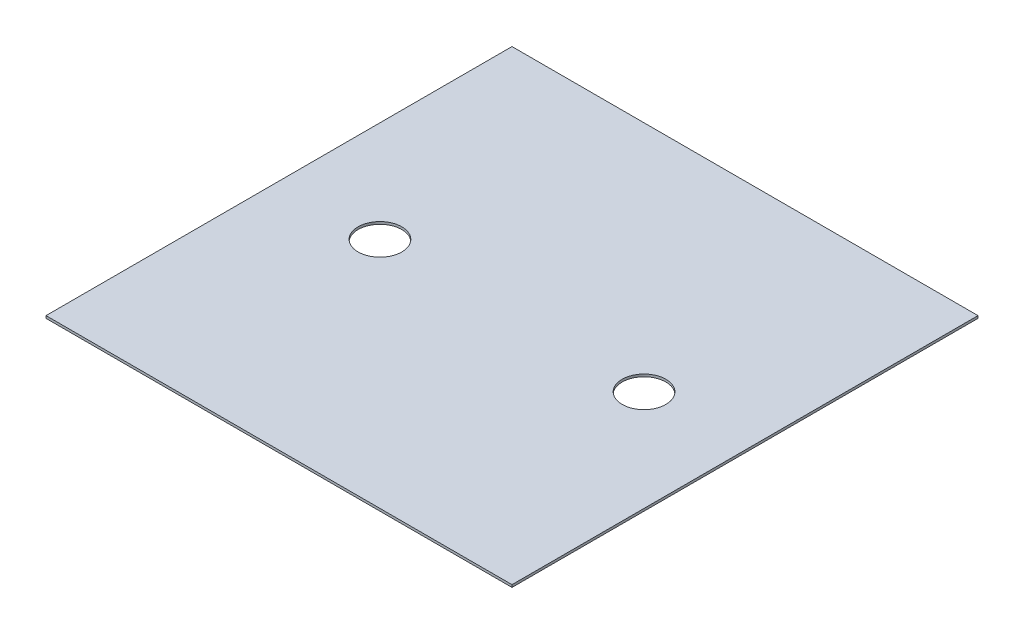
ISO-10303-21;
HEADER;
FILE_DESCRIPTION(('STEP AP214'),'2;1');
FILE_NAME('part.step','',(''),(''),'','','');
FILE_SCHEMA(('AUTOMOTIVE_DESIGN { 1 0 10303 214 1 1 1 1 }'));
ENDSEC;
DATA;
#1=APPLICATION_CONTEXT('core data for automotive mechanical design processes');
#2=APPLICATION_PROTOCOL_DEFINITION('international standard','automotive_design',2000,#1);
#3=PRODUCT_CONTEXT('',#1,'mechanical');
#4=PRODUCT('Part','Part','',(#3));
#5=PRODUCT_RELATED_PRODUCT_CATEGORY('part','',(#4));
#6=PRODUCT_DEFINITION_FORMATION('','',#4);
#7=PRODUCT_DEFINITION_CONTEXT('part definition',#1,'design');
#8=PRODUCT_DEFINITION('design','',#6,#7);
#9=PRODUCT_DEFINITION_SHAPE('','',#8);
#10=(LENGTH_UNIT() NAMED_UNIT(*) SI_UNIT(.MILLI.,.METRE.));
#11=(NAMED_UNIT(*) PLANE_ANGLE_UNIT() SI_UNIT($,.RADIAN.));
#12=(NAMED_UNIT(*) SI_UNIT($,.STERADIAN.) SOLID_ANGLE_UNIT());
#13=UNCERTAINTY_MEASURE_WITH_UNIT(LENGTH_MEASURE(1.E-05),#10,'distance_accuracy_value','');
#14=(GEOMETRIC_REPRESENTATION_CONTEXT(3) GLOBAL_UNCERTAINTY_ASSIGNED_CONTEXT((#13)) GLOBAL_UNIT_ASSIGNED_CONTEXT((#10,
#11,#12)) REPRESENTATION_CONTEXT('',''));
#15=CARTESIAN_POINT('',(0.,0.,0.));
#16=DIRECTION('',(0.,0.,1.));
#17=DIRECTION('',(1.,0.,0.));
#18=AXIS2_PLACEMENT_3D('',#15,#16,#17);
#19=CARTESIAN_POINT('',(-76.2,0.79375,-76.2));
#20=DIRECTION('',(1.,0.,0.));
#21=DIRECTION('',(0.,0.,-1.));
#22=AXIS2_PLACEMENT_3D('',#19,#20,#21);
#23=PLANE('',#22);
#24=DIRECTION('',(0.,0.,1.));
#25=VECTOR('',#24,1.);
#26=CARTESIAN_POINT('',(-76.2,0.,-76.2));
#27=LINE('',#26,#25);
#28=CARTESIAN_POINT('',(-76.2,0.,-76.2));
#29=VERTEX_POINT('',#28);
#30=CARTESIAN_POINT('',(-76.2,0.,76.2));
#31=VERTEX_POINT('',#30);
#32=EDGE_CURVE('E96',#29,#31,#27,.T.);
#33=ORIENTED_EDGE('',*,*,#32,.T.);
#34=DIRECTION('',(0.,-1.,0.));
#35=VECTOR('',#34,1.);
#36=CARTESIAN_POINT('',(-76.2,0.79375,76.2));
#37=LINE('',#36,#35);
#38=CARTESIAN_POINT('',(-76.2,0.79375,76.2));
#39=VERTEX_POINT('',#38);
#40=EDGE_CURVE('E11',#39,#31,#37,.T.);
#41=ORIENTED_EDGE('',*,*,#40,.F.);
#42=DIRECTION('',(0.,0.,1.));
#43=VECTOR('',#42,1.);
#44=CARTESIAN_POINT('',(-76.2,0.79375,-76.2));
#45=LINE('',#44,#43);
#46=CARTESIAN_POINT('',(-76.2,0.79375,-76.2));
#47=VERTEX_POINT('',#46);
#48=EDGE_CURVE('E84',#47,#39,#45,.T.);
#49=ORIENTED_EDGE('',*,*,#48,.F.);
#50=DIRECTION('',(0.,-1.,0.));
#51=VECTOR('',#50,1.);
#52=CARTESIAN_POINT('',(-76.2,0.79375,-76.2));
#53=LINE('',#52,#51);
#54=EDGE_CURVE('E92',#47,#29,#53,.T.);
#55=ORIENTED_EDGE('',*,*,#54,.T.);
#56=EDGE_LOOP('',(#33,#41,#49,#55));
#57=FACE_BOUND('',#56,.T.);
#58=ADVANCED_FACE('F33',(#57),#23,.F.);
#59=CARTESIAN_POINT('',(-76.2,0.79375,76.2));
#60=DIRECTION('',(0.,0.,-1.));
#61=DIRECTION('',(-1.,0.,0.));
#62=AXIS2_PLACEMENT_3D('',#59,#60,#61);
#63=PLANE('',#62);
#64=DIRECTION('',(1.,0.,0.));
#65=VECTOR('',#64,1.);
#66=CARTESIAN_POINT('',(-76.2,0.,76.2));
#67=LINE('',#66,#65);
#68=CARTESIAN_POINT('',(76.2,0.,76.2));
#69=VERTEX_POINT('',#68);
#70=EDGE_CURVE('E88',#31,#69,#67,.T.);
#71=ORIENTED_EDGE('',*,*,#70,.T.);
#72=DIRECTION('',(0.,-1.,0.));
#73=VECTOR('',#72,1.);
#74=CARTESIAN_POINT('',(76.2,0.79375,76.2));
#75=LINE('',#74,#73);
#76=CARTESIAN_POINT('',(76.2,0.79375,76.2));
#77=VERTEX_POINT('',#76);
#78=EDGE_CURVE('E41',#77,#69,#75,.T.);
#79=ORIENTED_EDGE('',*,*,#78,.F.);
#80=DIRECTION('',(1.,0.,0.));
#81=VECTOR('',#80,1.);
#82=CARTESIAN_POINT('',(-76.2,0.79375,76.2));
#83=LINE('',#82,#81);
#84=EDGE_CURVE('E79',#39,#77,#83,.T.);
#85=ORIENTED_EDGE('',*,*,#84,.F.);
#86=ORIENTED_EDGE('',*,*,#40,.T.);
#87=EDGE_LOOP('',(#71,#79,#85,#86));
#88=FACE_BOUND('',#87,.T.);
#89=ADVANCED_FACE('F87',(#88),#63,.F.);
#90=CARTESIAN_POINT('',(76.2,0.79375,-76.2));
#91=DIRECTION('',(-1.,0.,0.));
#92=DIRECTION('',(0.,0.,1.));
#93=AXIS2_PLACEMENT_3D('',#90,#91,#92);
#94=PLANE('',#93);
#95=DIRECTION('',(0.,0.,-1.));
#96=VECTOR('',#95,1.);
#97=CARTESIAN_POINT('',(76.2,0.,-76.2));
#98=LINE('',#97,#96);
#99=CARTESIAN_POINT('',(76.2,0.,-76.2));
#100=VERTEX_POINT('',#99);
#101=EDGE_CURVE('E66',#69,#100,#98,.T.);
#102=ORIENTED_EDGE('',*,*,#101,.T.);
#103=DIRECTION('',(0.,-1.,0.));
#104=VECTOR('',#103,1.);
#105=CARTESIAN_POINT('',(76.2,0.79375,-76.2));
#106=LINE('',#105,#104);
#107=CARTESIAN_POINT('',(76.2,0.79375,-76.2));
#108=VERTEX_POINT('',#107);
#109=EDGE_CURVE('E89',#108,#100,#106,.T.);
#110=ORIENTED_EDGE('',*,*,#109,.F.);
#111=DIRECTION('',(0.,0.,-1.));
#112=VECTOR('',#111,1.);
#113=CARTESIAN_POINT('',(76.2,0.79375,-76.2));
#114=LINE('',#113,#112);
#115=EDGE_CURVE('E82',#77,#108,#114,.T.);
#116=ORIENTED_EDGE('',*,*,#115,.F.);
#117=ORIENTED_EDGE('',*,*,#78,.T.);
#118=EDGE_LOOP('',(#102,#110,#116,#117));
#119=FACE_BOUND('',#118,.T.);
#120=ADVANCED_FACE('F90',(#119),#94,.F.);
#121=CARTESIAN_POINT('',(-76.2,0.79375,-76.2));
#122=DIRECTION('',(0.,0.,1.));
#123=DIRECTION('',(1.,0.,0.));
#124=AXIS2_PLACEMENT_3D('',#121,#122,#123);
#125=PLANE('',#124);
#126=DIRECTION('',(-1.,0.,0.));
#127=VECTOR('',#126,1.);
#128=CARTESIAN_POINT('',(-76.2,0.,-76.2));
#129=LINE('',#128,#127);
#130=EDGE_CURVE('E72',#100,#29,#129,.T.);
#131=ORIENTED_EDGE('',*,*,#130,.T.);
#132=ORIENTED_EDGE('',*,*,#54,.F.);
#133=DIRECTION('',(-1.,0.,0.));
#134=VECTOR('',#133,1.);
#135=CARTESIAN_POINT('',(-76.2,0.79375,-76.2));
#136=LINE('',#135,#134);
#137=EDGE_CURVE('E49',#108,#47,#136,.T.);
#138=ORIENTED_EDGE('',*,*,#137,.F.);
#139=ORIENTED_EDGE('',*,*,#109,.T.);
#140=EDGE_LOOP('',(#131,#132,#138,#139));
#141=FACE_BOUND('',#140,.T.);
#142=ADVANCED_FACE('F104',(#141),#125,.F.);
#143=CARTESIAN_POINT('',(0.,0.79375,0.));
#144=DIRECTION('',(0.,1.,0.));
#145=DIRECTION('',(0.,0.,1.));
#146=AXIS2_PLACEMENT_3D('',#143,#144,#145);
#147=PLANE('',#146);
#148=CARTESIAN_POINT('',(-43.18,0.793749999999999,0.));
#149=DIRECTION('',(0.,1.,0.));
#150=DIRECTION('',(0.,0.,1.));
#151=AXIS2_PLACEMENT_3D('',#148,#149,#150);
#152=CIRCLE('',#151,7.14375);
#153=CARTESIAN_POINT('',(-43.18,0.793749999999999,7.14375));
#154=VERTEX_POINT('',#153);
#155=EDGE_CURVE('E99',#154,#154,#152,.F.);
#156=ORIENTED_EDGE('',*,*,#155,.T.);
#157=EDGE_LOOP('',(#156));
#158=FACE_BOUND('',#157,.T.);
#159=CARTESIAN_POINT('',(43.18,0.793749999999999,0.));
#160=DIRECTION('',(0.,1.,0.));
#161=DIRECTION('',(0.,0.,1.));
#162=AXIS2_PLACEMENT_3D('',#159,#160,#161);
#163=CIRCLE('',#162,7.14375);
#164=CARTESIAN_POINT('',(43.18,0.793749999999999,7.14375));
#165=VERTEX_POINT('',#164);
#166=EDGE_CURVE('E112',#165,#165,#163,.F.);
#167=ORIENTED_EDGE('',*,*,#166,.T.);
#168=EDGE_LOOP('',(#167));
#169=FACE_BOUND('',#168,.T.);
#170=ORIENTED_EDGE('',*,*,#48,.T.);
#171=ORIENTED_EDGE('',*,*,#84,.T.);
#172=ORIENTED_EDGE('',*,*,#115,.T.);
#173=ORIENTED_EDGE('',*,*,#137,.T.);
#174=EDGE_LOOP('',(#170,#171,#172,#173));
#175=FACE_BOUND('',#174,.T.);
#176=ADVANCED_FACE('F80',(#158,#169,#175),#147,.T.);
#177=CARTESIAN_POINT('',(0.,0.,0.));
#178=DIRECTION('',(0.,1.,0.));
#179=DIRECTION('',(0.,0.,1.));
#180=AXIS2_PLACEMENT_3D('',#177,#178,#179);
#181=PLANE('',#180);
#182=CARTESIAN_POINT('',(-43.18,0.,0.));
#183=DIRECTION('',(0.,1.,0.));
#184=DIRECTION('',(0.,0.,1.));
#185=AXIS2_PLACEMENT_3D('',#182,#183,#184);
#186=CIRCLE('',#185,7.14375);
#187=CARTESIAN_POINT('',(-43.18,0.,7.14375));
#188=VERTEX_POINT('',#187);
#189=EDGE_CURVE('E115',#188,#188,#186,.T.);
#190=ORIENTED_EDGE('',*,*,#189,.T.);
#191=EDGE_LOOP('',(#190));
#192=FACE_BOUND('',#191,.T.);
#193=CARTESIAN_POINT('',(43.18,0.,0.));
#194=DIRECTION('',(0.,1.,0.));
#195=DIRECTION('',(0.,0.,1.));
#196=AXIS2_PLACEMENT_3D('',#193,#194,#195);
#197=CIRCLE('',#196,7.14375);
#198=CARTESIAN_POINT('',(43.18,0.,7.14375));
#199=VERTEX_POINT('',#198);
#200=EDGE_CURVE('E116',#199,#199,#197,.T.);
#201=ORIENTED_EDGE('',*,*,#200,.T.);
#202=EDGE_LOOP('',(#201));
#203=FACE_BOUND('',#202,.T.);
#204=ORIENTED_EDGE('',*,*,#32,.F.);
#205=ORIENTED_EDGE('',*,*,#130,.F.);
#206=ORIENTED_EDGE('',*,*,#101,.F.);
#207=ORIENTED_EDGE('',*,*,#70,.F.);
#208=EDGE_LOOP('',(#204,#205,#206,#207));
#209=FACE_BOUND('',#208,.T.);
#210=ADVANCED_FACE('F107',(#192,#203,#209),#181,.F.);
#211=CARTESIAN_POINT('',(43.18,25.4,0.));
#212=DIRECTION('',(0.,-1.,0.));
#213=DIRECTION('',(0.,0.,-1.));
#214=AXIS2_PLACEMENT_3D('',#211,#212,#213);
#215=CYLINDRICAL_SURFACE('',#214,7.14375);
#216=ORIENTED_EDGE('',*,*,#166,.F.);
#217=EDGE_LOOP('',(#216));
#218=FACE_BOUND('',#217,.T.);
#219=ORIENTED_EDGE('',*,*,#200,.F.);
#220=EDGE_LOOP('',(#219));
#221=FACE_BOUND('',#220,.T.);
#222=ADVANCED_FACE('F126',(#218,#221),#215,.F.);
#223=CARTESIAN_POINT('',(-43.18,25.4,0.));
#224=DIRECTION('',(0.,-1.,0.));
#225=DIRECTION('',(0.,0.,-1.));
#226=AXIS2_PLACEMENT_3D('',#223,#224,#225);
#227=CYLINDRICAL_SURFACE('',#226,7.14375);
#228=ORIENTED_EDGE('',*,*,#155,.F.);
#229=EDGE_LOOP('',(#228));
#230=FACE_BOUND('',#229,.T.);
#231=ORIENTED_EDGE('',*,*,#189,.F.);
#232=EDGE_LOOP('',(#231));
#233=FACE_BOUND('',#232,.T.);
#234=ADVANCED_FACE('F124',(#230,#233),#227,.F.);
#235=CLOSED_SHELL('',(#58,#89,#120,#142,#176,#210,#222,#234));
#236=MANIFOLD_SOLID_BREP('B2',#235);
#237=ADVANCED_BREP_SHAPE_REPRESENTATION('',(#18,#236),#14);
#238=SHAPE_DEFINITION_REPRESENTATION(#9,#237);
ENDSEC;
END-ISO-10303-21;
